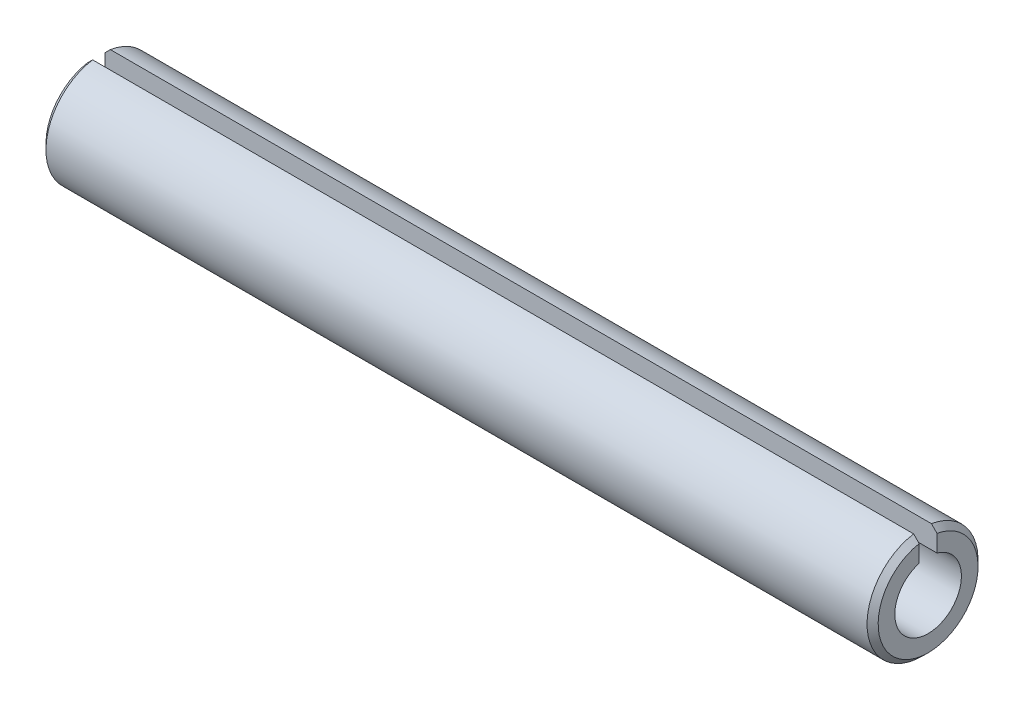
from build123d import *

# Parameters (mm, degrees)
ENL_V_MAT_EXTRU_2_DEPTH = 31.133038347


with BuildPart() as part:
    # Esquisse1 → Base-R_volution (revolve)
    with BuildSketch(Plane.XY):
        Polygon((0, 1.2), (0, 1.8), (0.2, 2), (29.8, 2), (30, 1.8), (30, 1.2), align=None)
    revolve(axis=Axis((0, 0, 0), (1, 0, 0)))

    # Esquisse2 → Enl_v. mat.-Extru.2 (cut, through all)
    with BuildSketch(Plane(origin=(0, 0, 0), x_dir=(0, 0, -1), z_dir=(1, 0, 0))):
        with BuildLine():
            Line((0.32, 1.974234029), (0.32, 1.156546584))
            ThreePointArc((0.32, 1.156546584), (0, 1.2), (-0.32, 1.156546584))
            Line((-0.32, 1.156546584), (-0.32, 1.974234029))
            ThreePointArc((-0.32, 1.974234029), (0, 2), (0.32, 1.974234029))
        make_face()
    extrude(amount=ENL_V_MAT_EXTRU_2_DEPTH, mode=Mode.SUBTRACT)


solid = part.part
